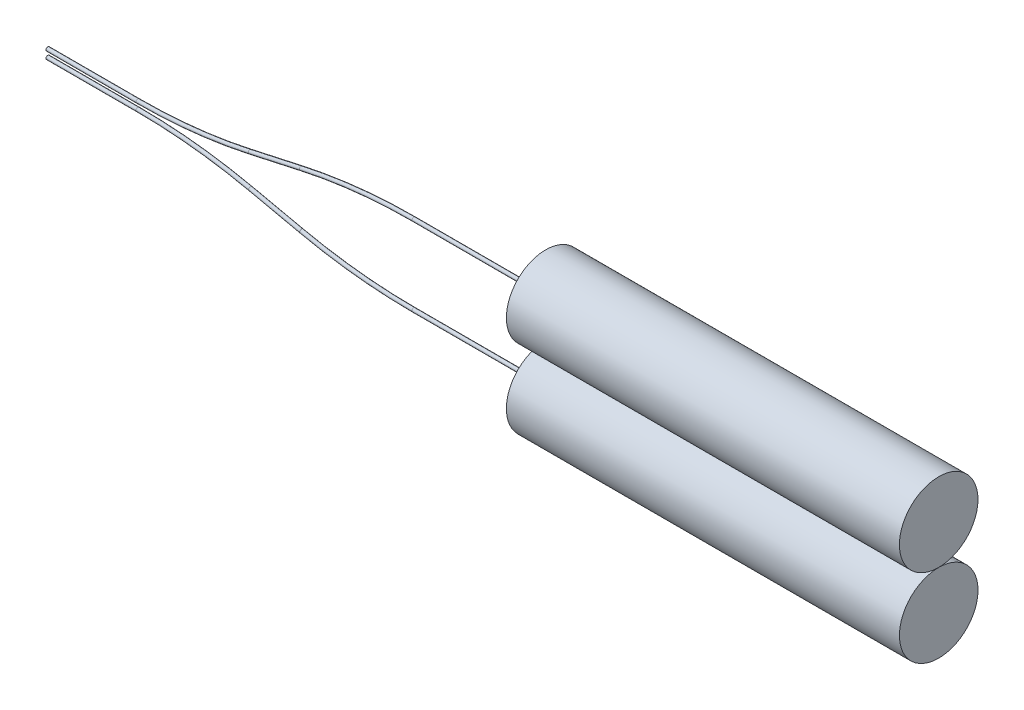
ISO-10303-21;
HEADER;
FILE_DESCRIPTION(('STEP AP214'),'2;1');
FILE_NAME('part.step','',(''),(''),'','','');
FILE_SCHEMA(('AUTOMOTIVE_DESIGN { 1 0 10303 214 1 1 1 1 }'));
ENDSEC;
DATA;
#1=APPLICATION_CONTEXT('core data for automotive mechanical design processes');
#2=APPLICATION_PROTOCOL_DEFINITION('international standard','automotive_design',2000,#1);
#3=PRODUCT_CONTEXT('',#1,'mechanical');
#4=PRODUCT('Part','Part','',(#3));
#5=PRODUCT_RELATED_PRODUCT_CATEGORY('part','',(#4));
#6=PRODUCT_DEFINITION_FORMATION('','',#4);
#7=PRODUCT_DEFINITION_CONTEXT('part definition',#1,'design');
#8=PRODUCT_DEFINITION('design','',#6,#7);
#9=PRODUCT_DEFINITION_SHAPE('','',#8);
#10=(LENGTH_UNIT() NAMED_UNIT(*) SI_UNIT(.MILLI.,.METRE.));
#11=(NAMED_UNIT(*) PLANE_ANGLE_UNIT() SI_UNIT($,.RADIAN.));
#12=(NAMED_UNIT(*) SI_UNIT($,.STERADIAN.) SOLID_ANGLE_UNIT());
#13=UNCERTAINTY_MEASURE_WITH_UNIT(LENGTH_MEASURE(1.E-05),#10,'distance_accuracy_value','');
#14=(GEOMETRIC_REPRESENTATION_CONTEXT(3) GLOBAL_UNCERTAINTY_ASSIGNED_CONTEXT((#13)) GLOBAL_UNIT_ASSIGNED_CONTEXT((#10,
#11,#12)) REPRESENTATION_CONTEXT('',''));
#15=CARTESIAN_POINT('',(0.,0.,0.));
#16=DIRECTION('',(0.,0.,1.));
#17=DIRECTION('',(1.,0.,0.));
#18=AXIS2_PLACEMENT_3D('',#15,#16,#17);
#19=CARTESIAN_POINT('',(18.,-1.5,-3.44142135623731));
#20=DIRECTION('',(1.,0.,0.));
#21=DIRECTION('',(0.,0.,-1.));
#22=AXIS2_PLACEMENT_3D('',#19,#20,#21);
#23=PLANE('',#22);
#24=CARTESIAN_POINT('',(18.,-1.5,0.));
#25=DIRECTION('',(-1.,0.,0.));
#26=DIRECTION('',(0.,0.,-1.));
#27=AXIS2_PLACEMENT_3D('',#24,#25,#26);
#28=CIRCLE('',#27,1.5);
#29=CARTESIAN_POINT('',(18.,-1.5,-1.5));
#30=VERTEX_POINT('',#29);
#31=EDGE_CURVE('E51',#30,#30,#28,.T.);
#32=ORIENTED_EDGE('',*,*,#31,.T.);
#33=EDGE_LOOP('',(#32));
#34=FACE_BOUND('',#33,.T.);
#35=CARTESIAN_POINT('',(18.,-1.5,0.));
#36=DIRECTION('',(-1.,0.,0.));
#37=DIRECTION('',(0.,0.,-1.));
#38=AXIS2_PLACEMENT_3D('',#35,#36,#37);
#39=CIRCLE('',#38,0.07);
#40=CARTESIAN_POINT('',(18.,-1.5,-0.07));
#41=VERTEX_POINT('',#40);
#42=EDGE_CURVE('E11',#41,#41,#39,.F.);
#43=ORIENTED_EDGE('',*,*,#42,.T.);
#44=EDGE_LOOP('',(#43));
#45=FACE_BOUND('',#44,.T.);
#46=ADVANCED_FACE('F40',(#34,#45),#23,.F.);
#47=CARTESIAN_POINT('',(33.,-1.5,0.));
#48=DIRECTION('',(-1.,0.,0.));
#49=DIRECTION('',(0.,0.,1.));
#50=AXIS2_PLACEMENT_3D('',#47,#48,#49);
#51=CYLINDRICAL_SURFACE('',#50,1.5);
#52=CARTESIAN_POINT('',(33.,-1.5,0.));
#53=DIRECTION('',(-1.,0.,0.));
#54=DIRECTION('',(0.,0.,-1.));
#55=AXIS2_PLACEMENT_3D('',#52,#53,#54);
#56=CIRCLE('',#55,1.5);
#57=CARTESIAN_POINT('',(33.,-1.5,-1.5));
#58=VERTEX_POINT('',#57);
#59=EDGE_CURVE('E47',#58,#58,#56,.T.);
#60=ORIENTED_EDGE('',*,*,#59,.T.);
#61=EDGE_LOOP('',(#60));
#62=FACE_BOUND('',#61,.T.);
#63=ORIENTED_EDGE('',*,*,#31,.F.);
#64=EDGE_LOOP('',(#63));
#65=FACE_BOUND('',#64,.T.);
#66=ADVANCED_FACE('F42',(#62,#65),#51,.T.);
#67=CARTESIAN_POINT('',(33.,-1.5,-3.44142135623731));
#68=DIRECTION('',(1.,0.,0.));
#69=DIRECTION('',(0.,0.,-1.));
#70=AXIS2_PLACEMENT_3D('',#67,#68,#69);
#71=PLANE('',#70);
#72=ORIENTED_EDGE('',*,*,#59,.F.);
#73=EDGE_LOOP('',(#72));
#74=FACE_BOUND('',#73,.T.);
#75=ADVANCED_FACE('F92',(#74),#71,.T.);
#76=CARTESIAN_POINT('',(12.9681381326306,-1.49999999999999,0.));
#77=DIRECTION('',(1.,0.,0.));
#78=DIRECTION('',(0.,-1.,0.));
#79=AXIS2_PLACEMENT_3D('',#76,#77,#78);
#80=CYLINDRICAL_SURFACE('',#79,0.07);
#81=CARTESIAN_POINT('',(12.9681381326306,-1.49999999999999,0.));
#82=DIRECTION('',(1.,0.,0.));
#83=DIRECTION('',(0.,0.,1.));
#84=AXIS2_PLACEMENT_3D('',#81,#82,#83);
#85=CIRCLE('',#84,0.07);
#86=CARTESIAN_POINT('',(12.9681381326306,-1.56999999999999,0.));
#87=VERTEX_POINT('',#86);
#88=EDGE_CURVE('E56',#87,#87,#85,.T.);
#89=ORIENTED_EDGE('',*,*,#88,.T.);
#90=EDGE_LOOP('',(#89));
#91=FACE_BOUND('',#90,.T.);
#92=ORIENTED_EDGE('',*,*,#42,.F.);
#93=EDGE_LOOP('',(#92));
#94=FACE_BOUND('',#93,.T.);
#95=ADVANCED_FACE('F96',(#91,#94),#80,.T.);
#96=CARTESIAN_POINT('',(12.9681381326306,18.5,0.));
#97=DIRECTION('',(0.,0.,-1.));
#98=DIRECTION('',(-1.,0.,0.));
#99=AXIS2_PLACEMENT_3D('',#96,#97,#98);
#100=TOROIDAL_SURFACE('',#99,20.,0.07);
#101=CARTESIAN_POINT('',(8.67698140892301,-1.0342257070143,0.));
#102=DIRECTION('',(0.976711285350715,-0.214557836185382,0.));
#103=DIRECTION('',(0.,0.,1.));
#104=AXIS2_PLACEMENT_3D('',#101,#102,#103);
#105=CIRCLE('',#104,0.07);
#106=CARTESIAN_POINT('',(8.66196236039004,-1.10259549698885,0.));
#107=VERTEX_POINT('',#106);
#108=EDGE_CURVE('E60',#107,#107,#105,.T.);
#109=CARTESIAN_POINT('',(12.9681381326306,18.5,0.));
#110=DIRECTION('',(0.,0.,-1.));
#111=DIRECTION('',(-1.,0.,0.));
#112=AXIS2_PLACEMENT_3D('',#109,#110,#111);
#113=CIRCLE('',#112,20.07);
#114=EDGE_CURVE('',#87,#107,#113,.T.);
#115=ORIENTED_EDGE('',*,*,#88,.F.);
#116=ORIENTED_EDGE('',*,*,#108,.T.);
#117=ORIENTED_EDGE('',*,*,#114,.T.);
#118=ORIENTED_EDGE('',*,*,#114,.F.);
#119=EDGE_LOOP('',(#115,#117,#116,#118));
#120=FACE_BOUND('',#119,.T.);
#121=ADVANCED_FACE('F100',(#120),#100,.T.);
#122=CARTESIAN_POINT('',(6.72658267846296,-0.605774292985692,0.));
#123=DIRECTION('',(0.976711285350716,-0.214557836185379,0.));
#124=DIRECTION('',(-0.214557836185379,-0.976711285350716,0.));
#125=AXIS2_PLACEMENT_3D('',#122,#123,#124);
#126=CYLINDRICAL_SURFACE('',#125,0.07);
#127=CARTESIAN_POINT('',(6.72658267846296,-0.605774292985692,0.));
#128=DIRECTION('',(0.976711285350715,-0.214557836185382,0.));
#129=DIRECTION('',(0.,0.,1.));
#130=AXIS2_PLACEMENT_3D('',#127,#128,#129);
#131=CIRCLE('',#130,0.07);
#132=CARTESIAN_POINT('',(6.74160172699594,-0.537404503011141,0.));
#133=VERTEX_POINT('',#132);
#134=EDGE_CURVE('E63',#133,#133,#131,.T.);
#135=ORIENTED_EDGE('',*,*,#134,.T.);
#136=EDGE_LOOP('',(#135));
#137=FACE_BOUND('',#136,.T.);
#138=ORIENTED_EDGE('',*,*,#108,.F.);
#139=EDGE_LOOP('',(#138));
#140=FACE_BOUND('',#139,.T.);
#141=ADVANCED_FACE('F104',(#137,#140),#126,.T.);
#142=CARTESIAN_POINT('',(2.43542595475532,-20.14,0.));
#143=DIRECTION('',(0.,0.,1.));
#144=DIRECTION('',(1.,0.,0.));
#145=AXIS2_PLACEMENT_3D('',#142,#143,#144);
#146=TOROIDAL_SURFACE('',#145,20.,0.07);
#147=CARTESIAN_POINT('',(2.43542595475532,-0.140000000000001,0.));
#148=DIRECTION('',(1.,0.,0.));
#149=DIRECTION('',(0.,0.,1.));
#150=AXIS2_PLACEMENT_3D('',#147,#148,#149);
#151=CIRCLE('',#150,0.07);
#152=CARTESIAN_POINT('',(2.43542595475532,-0.0700000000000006,0.));
#153=VERTEX_POINT('',#152);
#154=EDGE_CURVE('E66',#153,#153,#151,.T.);
#155=CARTESIAN_POINT('',(2.43542595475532,-20.14,0.));
#156=DIRECTION('',(0.,0.,1.));
#157=DIRECTION('',(1.,0.,0.));
#158=AXIS2_PLACEMENT_3D('',#155,#156,#157);
#159=CIRCLE('',#158,20.07);
#160=EDGE_CURVE('',#133,#153,#159,.T.);
#161=ORIENTED_EDGE('',*,*,#134,.F.);
#162=ORIENTED_EDGE('',*,*,#154,.T.);
#163=ORIENTED_EDGE('',*,*,#160,.T.);
#164=ORIENTED_EDGE('',*,*,#160,.F.);
#165=EDGE_LOOP('',(#161,#163,#162,#164));
#166=FACE_BOUND('',#165,.T.);
#167=ADVANCED_FACE('F73',(#166),#146,.T.);
#168=CARTESIAN_POINT('',(2.43542595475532,-0.140000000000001,0.));
#169=DIRECTION('',(-1.,0.,0.));
#170=DIRECTION('',(0.,1.,0.));
#171=AXIS2_PLACEMENT_3D('',#168,#169,#170);
#172=CYLINDRICAL_SURFACE('',#171,0.07);
#173=ORIENTED_EDGE('',*,*,#154,.F.);
#174=EDGE_LOOP('',(#173));
#175=FACE_BOUND('',#174,.T.);
#176=CARTESIAN_POINT('',(-1.,-0.14,0.));
#177=DIRECTION('',(1.,0.,0.));
#178=DIRECTION('',(0.,0.,1.));
#179=AXIS2_PLACEMENT_3D('',#176,#177,#178);
#180=CIRCLE('',#179,0.07);
#181=CARTESIAN_POINT('',(-1.,-0.14,0.07));
#182=VERTEX_POINT('',#181);
#183=EDGE_CURVE('E67',#182,#182,#180,.T.);
#184=ORIENTED_EDGE('',*,*,#183,.T.);
#185=EDGE_LOOP('',(#184));
#186=FACE_BOUND('',#185,.T.);
#187=ADVANCED_FACE('F76',(#175,#186),#172,.T.);
#188=CARTESIAN_POINT('',(-1.,-0.14,0.));
#189=DIRECTION('',(-1.,0.,0.));
#190=DIRECTION('',(0.,0.,1.));
#191=AXIS2_PLACEMENT_3D('',#188,#189,#190);
#192=PLANE('',#191);
#193=ORIENTED_EDGE('',*,*,#183,.F.);
#194=EDGE_LOOP('',(#193));
#195=FACE_BOUND('',#194,.T.);
#196=ADVANCED_FACE('F79',(#195),#192,.T.);
#197=CLOSED_SHELL('',(#46,#66,#75,#95,#121,#141,#167,#187,#196));
#198=MANIFOLD_SOLID_BREP('B2',#197);
#199=CARTESIAN_POINT('',(18.,1.5,-3.44142135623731));
#200=DIRECTION('',(1.,0.,0.));
#201=DIRECTION('',(0.,0.,-1.));
#202=AXIS2_PLACEMENT_3D('',#199,#200,#201);
#203=PLANE('',#202);
#204=CARTESIAN_POINT('',(18.,1.5,0.));
#205=DIRECTION('',(1.,0.,0.));
#206=DIRECTION('',(0.,0.,-1.));
#207=AXIS2_PLACEMENT_3D('',#204,#205,#206);
#208=CIRCLE('',#207,1.5);
#209=CARTESIAN_POINT('',(18.,1.5,-1.5));
#210=VERTEX_POINT('',#209);
#211=EDGE_CURVE('E192',#210,#210,#208,.T.);
#212=ORIENTED_EDGE('',*,*,#211,.F.);
#213=EDGE_LOOP('',(#212));
#214=FACE_BOUND('',#213,.T.);
#215=CARTESIAN_POINT('',(18.,1.5,0.));
#216=DIRECTION('',(1.,0.,0.));
#217=DIRECTION('',(0.,0.,-1.));
#218=AXIS2_PLACEMENT_3D('',#215,#216,#217);
#219=CIRCLE('',#218,0.07);
#220=CARTESIAN_POINT('',(18.,1.5,-0.07));
#221=VERTEX_POINT('',#220);
#222=EDGE_CURVE('E39',#221,#221,#219,.F.);
#223=ORIENTED_EDGE('',*,*,#222,.F.);
#224=EDGE_LOOP('',(#223));
#225=FACE_BOUND('',#224,.T.);
#226=ADVANCED_FACE('F181',(#214,#225),#203,.F.);
#227=CARTESIAN_POINT('',(33.,1.5,0.));
#228=DIRECTION('',(-1.,0.,0.));
#229=DIRECTION('',(0.,0.,1.));
#230=AXIS2_PLACEMENT_3D('',#227,#228,#229);
#231=CYLINDRICAL_SURFACE('',#230,1.5);
#232=CARTESIAN_POINT('',(33.,1.5,0.));
#233=DIRECTION('',(1.,0.,0.));
#234=DIRECTION('',(0.,0.,-1.));
#235=AXIS2_PLACEMENT_3D('',#232,#233,#234);
#236=CIRCLE('',#235,1.5);
#237=CARTESIAN_POINT('',(33.,1.5,-1.5));
#238=VERTEX_POINT('',#237);
#239=EDGE_CURVE('E188',#238,#238,#236,.T.);
#240=ORIENTED_EDGE('',*,*,#239,.F.);
#241=EDGE_LOOP('',(#240));
#242=FACE_BOUND('',#241,.T.);
#243=ORIENTED_EDGE('',*,*,#211,.T.);
#244=EDGE_LOOP('',(#243));
#245=FACE_BOUND('',#244,.T.);
#246=ADVANCED_FACE('F183',(#242,#245),#231,.T.);
#247=CARTESIAN_POINT('',(33.,1.5,-3.44142135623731));
#248=DIRECTION('',(1.,0.,0.));
#249=DIRECTION('',(0.,0.,-1.));
#250=AXIS2_PLACEMENT_3D('',#247,#248,#249);
#251=PLANE('',#250);
#252=ORIENTED_EDGE('',*,*,#239,.T.);
#253=EDGE_LOOP('',(#252));
#254=FACE_BOUND('',#253,.T.);
#255=ADVANCED_FACE('F237',(#254),#251,.T.);
#256=CARTESIAN_POINT('',(12.9681381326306,1.49999999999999,0.));
#257=DIRECTION('',(1.,0.,0.));
#258=DIRECTION('',(0.,1.,0.));
#259=AXIS2_PLACEMENT_3D('',#256,#257,#258);
#260=CYLINDRICAL_SURFACE('',#259,0.07);
#261=CARTESIAN_POINT('',(12.9681381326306,1.49999999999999,0.));
#262=DIRECTION('',(-1.,0.,0.));
#263=DIRECTION('',(0.,0.,1.));
#264=AXIS2_PLACEMENT_3D('',#261,#262,#263);
#265=CIRCLE('',#264,0.07);
#266=CARTESIAN_POINT('',(12.9681381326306,1.56999999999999,0.));
#267=VERTEX_POINT('',#266);
#268=EDGE_CURVE('E197',#267,#267,#265,.T.);
#269=ORIENTED_EDGE('',*,*,#268,.F.);
#270=EDGE_LOOP('',(#269));
#271=FACE_BOUND('',#270,.T.);
#272=ORIENTED_EDGE('',*,*,#222,.T.);
#273=EDGE_LOOP('',(#272));
#274=FACE_BOUND('',#273,.T.);
#275=ADVANCED_FACE('F232',(#271,#274),#260,.T.);
#276=CARTESIAN_POINT('',(12.9681381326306,-18.5,0.));
#277=DIRECTION('',(0.,0.,-1.));
#278=DIRECTION('',(-1.,0.,0.));
#279=AXIS2_PLACEMENT_3D('',#276,#277,#278);
#280=TOROIDAL_SURFACE('',#279,20.,0.07);
#281=CARTESIAN_POINT('',(8.67698140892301,1.0342257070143,0.));
#282=DIRECTION('',(-0.976711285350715,-0.214557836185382,0.));
#283=DIRECTION('',(0.,0.,1.));
#284=AXIS2_PLACEMENT_3D('',#281,#282,#283);
#285=CIRCLE('',#284,0.07);
#286=CARTESIAN_POINT('',(8.66196236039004,1.10259549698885,0.));
#287=VERTEX_POINT('',#286);
#288=EDGE_CURVE('E201',#287,#287,#285,.T.);
#289=CARTESIAN_POINT('',(12.9681381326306,-18.5,0.));
#290=DIRECTION('',(0.,0.,-1.));
#291=DIRECTION('',(-1.,0.,0.));
#292=AXIS2_PLACEMENT_3D('',#289,#290,#291);
#293=CIRCLE('',#292,20.07);
#294=EDGE_CURVE('',#287,#267,#293,.T.);
#295=ORIENTED_EDGE('',*,*,#288,.F.);
#296=ORIENTED_EDGE('',*,*,#268,.T.);
#297=ORIENTED_EDGE('',*,*,#294,.T.);
#298=ORIENTED_EDGE('',*,*,#294,.F.);
#299=EDGE_LOOP('',(#295,#297,#296,#298));
#300=FACE_BOUND('',#299,.T.);
#301=ADVANCED_FACE('F226',(#300),#280,.T.);
#302=CARTESIAN_POINT('',(6.72658267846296,0.605774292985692,0.));
#303=DIRECTION('',(0.976711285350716,0.214557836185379,0.));
#304=DIRECTION('',(-0.214557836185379,0.976711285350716,0.));
#305=AXIS2_PLACEMENT_3D('',#302,#303,#304);
#306=CYLINDRICAL_SURFACE('',#305,0.07);
#307=CARTESIAN_POINT('',(6.72658267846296,0.605774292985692,0.));
#308=DIRECTION('',(-0.976711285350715,-0.214557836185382,0.));
#309=DIRECTION('',(0.,0.,1.));
#310=AXIS2_PLACEMENT_3D('',#307,#308,#309);
#311=CIRCLE('',#310,0.07);
#312=CARTESIAN_POINT('',(6.74160172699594,0.537404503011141,0.));
#313=VERTEX_POINT('',#312);
#314=EDGE_CURVE('E204',#313,#313,#311,.T.);
#315=ORIENTED_EDGE('',*,*,#314,.F.);
#316=EDGE_LOOP('',(#315));
#317=FACE_BOUND('',#316,.T.);
#318=ORIENTED_EDGE('',*,*,#288,.T.);
#319=EDGE_LOOP('',(#318));
#320=FACE_BOUND('',#319,.T.);
#321=ADVANCED_FACE('F220',(#317,#320),#306,.T.);
#322=CARTESIAN_POINT('',(2.43542595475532,20.14,0.));
#323=DIRECTION('',(0.,0.,1.));
#324=DIRECTION('',(1.,0.,0.));
#325=AXIS2_PLACEMENT_3D('',#322,#323,#324);
#326=TOROIDAL_SURFACE('',#325,20.,0.07);
#327=CARTESIAN_POINT('',(2.43542595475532,0.140000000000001,0.));
#328=DIRECTION('',(-1.,0.,0.));
#329=DIRECTION('',(0.,0.,1.));
#330=AXIS2_PLACEMENT_3D('',#327,#328,#329);
#331=CIRCLE('',#330,0.07);
#332=CARTESIAN_POINT('',(2.43542595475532,0.0700000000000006,0.));
#333=VERTEX_POINT('',#332);
#334=EDGE_CURVE('E207',#333,#333,#331,.T.);
#335=CARTESIAN_POINT('',(2.43542595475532,20.14,0.));
#336=DIRECTION('',(0.,0.,1.));
#337=DIRECTION('',(1.,0.,0.));
#338=AXIS2_PLACEMENT_3D('',#335,#336,#337);
#339=CIRCLE('',#338,20.07);
#340=EDGE_CURVE('',#333,#313,#339,.T.);
#341=ORIENTED_EDGE('',*,*,#334,.F.);
#342=ORIENTED_EDGE('',*,*,#314,.T.);
#343=ORIENTED_EDGE('',*,*,#340,.T.);
#344=ORIENTED_EDGE('',*,*,#340,.F.);
#345=EDGE_LOOP('',(#341,#343,#342,#344));
#346=FACE_BOUND('',#345,.T.);
#347=ADVANCED_FACE('F217',(#346),#326,.T.);
#348=CARTESIAN_POINT('',(2.43542595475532,0.140000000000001,0.));
#349=DIRECTION('',(-1.,0.,0.));
#350=DIRECTION('',(0.,-1.,0.));
#351=AXIS2_PLACEMENT_3D('',#348,#349,#350);
#352=CYLINDRICAL_SURFACE('',#351,0.07);
#353=ORIENTED_EDGE('',*,*,#334,.T.);
#354=EDGE_LOOP('',(#353));
#355=FACE_BOUND('',#354,.T.);
#356=CARTESIAN_POINT('',(-1.,0.14,0.));
#357=DIRECTION('',(-1.,0.,0.));
#358=DIRECTION('',(0.,0.,1.));
#359=AXIS2_PLACEMENT_3D('',#356,#357,#358);
#360=CIRCLE('',#359,0.07);
#361=CARTESIAN_POINT('',(-1.,0.14,0.07));
#362=VERTEX_POINT('',#361);
#363=EDGE_CURVE('E208',#362,#362,#360,.T.);
#364=ORIENTED_EDGE('',*,*,#363,.F.);
#365=EDGE_LOOP('',(#364));
#366=FACE_BOUND('',#365,.T.);
#367=ADVANCED_FACE('F214',(#355,#366),#352,.T.);
#368=CARTESIAN_POINT('',(-1.,0.14,0.));
#369=DIRECTION('',(-1.,0.,0.));
#370=DIRECTION('',(0.,0.,1.));
#371=AXIS2_PLACEMENT_3D('',#368,#369,#370);
#372=PLANE('',#371);
#373=ORIENTED_EDGE('',*,*,#363,.T.);
#374=EDGE_LOOP('',(#373));
#375=FACE_BOUND('',#374,.T.);
#376=ADVANCED_FACE('F297',(#375),#372,.T.);
#377=CLOSED_SHELL('',(#226,#246,#255,#275,#301,#321,#347,#367,#376));
#378=MANIFOLD_SOLID_BREP('B6',#377);
#379=ADVANCED_BREP_SHAPE_REPRESENTATION('',(#18,#198,#378),#14);
#380=SHAPE_DEFINITION_REPRESENTATION(#9,#379);
ENDSEC;
END-ISO-10303-21;
